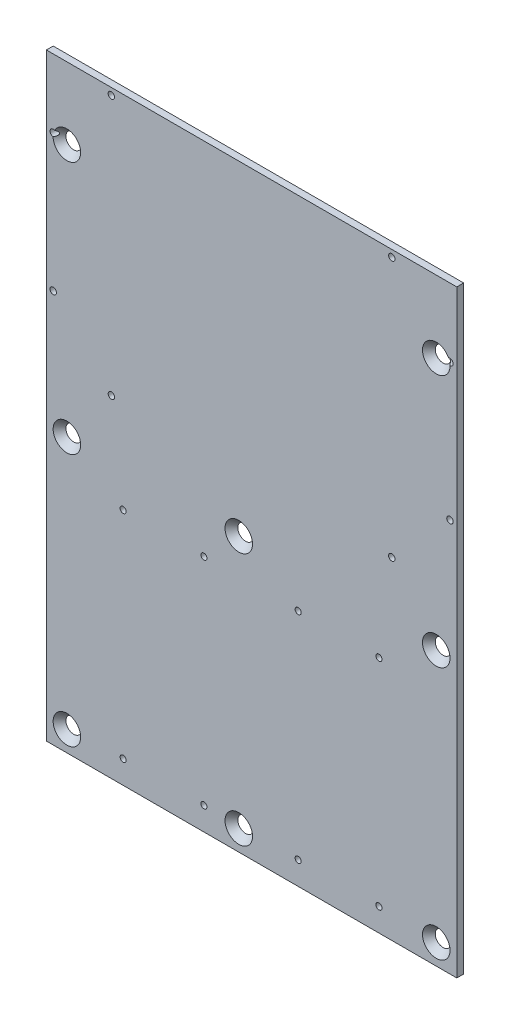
from build123d import *

# Parameters (mm, degrees)
SKETCH1_W                                    = 152.4
SKETCH1_H                                    = 222.25
BOSS_EXTRUDE1_DEPTH                          = 2.54
F_3_32_0_09375_DIAMETER_HOLE1_D              = 2.38125
F_4_40_TAPPED_HOLE1_D                        = 2.2606
CSK_FOR_10_FLAT_HEAD_MACHINE_SCREW1_AT_COUNT = 2
CSK_FOR_10_FLAT_HEAD_MACHINE_SCREW1_AT_PITCH = 63.8302
CSK_FOR_10_FLAT_HEAD_MACHINE_SCREW1_2_COUNT  = 2
CSK_FOR_10_FLAT_HEAD_MACHINE_SCREW1_2_PITCH  = 73.3298
CSK_FOR_10_FLAT_HEAD_MACHINE_SCREW1_3_COUNT  = 2
CSK_FOR_10_FLAT_HEAD_MACHINE_SCREW1_3_PITCH  = 93.98
CSK_FOR_10_FLAT_HEAD_MACHINE_SCREW1_4_COUNT  = 2
CSK_FOR_10_FLAT_HEAD_MACHINE_SCREW1_4_PITCH  = 113.606931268
CSK_FOR_10_FLAT_HEAD_MACHINE_SCREW1_5_COUNT  = 2
CSK_FOR_10_FLAT_HEAD_MACHINE_SCREW1_5_PITCH  = 119.203607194
CSK_FOR_10_FLAT_HEAD_MACHINE_SCREW1_6_COUNT  = 2
CSK_FOR_10_FLAT_HEAD_MACHINE_SCREW1_6_PITCH  = 201.757828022
CSK_FOR_10_FLAT_HEAD_MACHINE_SCREW1_7_COUNT  = 2
CSK_FOR_10_FLAT_HEAD_MACHINE_SCREW1_7_PITCH  = 198.50253407


with BuildPart() as part:
    # Sketch1 → Boss-Extrude1 (new body)
    with BuildSketch(Plane.XY):
        Rectangle(SKETCH1_W, SKETCH1_H)
    extrude(amount=BOSS_EXTRUDE1_DEPTH)

    # 3_32 _0.09375_ Diameter Hole1 (through all)
    with Locations(Plane.XY.offset(2.54)):
        with Locations((52.07, 108.585), (73.66, 85.725), (73.66, 34.925), (52.07, 12.065), (-52.07, 12.065), (-73.66, 34.925), (-52.07, 108.585), (-73.66, 85.725)):
            Hole(F_3_32_0_09375_DIAMETER_HOLE1_D / 2)

    # 4-40 Tapped Hole1 (through all)
    with Locations(Plane.XY.offset(2.54)):
        with Locations((47.3, -22.545), (-17.7, -22.545), (-47.7, -22.545), (17.3, -22.545), (47.3, -102.545), (17.3, -102.545), (-17.7, -102.545), (-47.7, -102.545)):
            Hole(F_4_40_TAPPED_HOLE1_D / 2)

    # Sketch9 → CSK for _10 Flat Head Machine Screw1 (revolve, cut)
    with BuildSketch(Plane(origin=(-4.7498, -103.505, 2.54), x_dir=(0, -1, 0), z_dir=(1, 0, 0))):
        Polygon((0, 0), (0, 2.54), (2.5527, 2.54), (2.5527, 2.942184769), (5.1103022, 0), align=None)
    csk_for_10_flat_head_machine_screw1 = revolve(axis=Axis((-4.7498, -103.505, 8.89), (0, 0, -1)), mode=Mode.SUBTRACT)

    # CSK for _10 Flat Head Machine Screw1 at: CSK for _10 Flat Head Machine Screw1 ×2
    with Locations(*[(-i * CSK_FOR_10_FLAT_HEAD_MACHINE_SCREW1_AT_PITCH, 0, 0) for i in range(1, CSK_FOR_10_FLAT_HEAD_MACHINE_SCREW1_AT_COUNT)]):
        add(csk_for_10_flat_head_machine_screw1, mode=Mode.SUBTRACT)

    # CSK for _10 Flat Head Machine Screw1 2: CSK for _10 Flat Head Machine Screw1 ×2
    with Locations(*[(i * CSK_FOR_10_FLAT_HEAD_MACHINE_SCREW1_2_PITCH, 0, 0) for i in range(1, CSK_FOR_10_FLAT_HEAD_MACHINE_SCREW1_2_COUNT)]):
        add(csk_for_10_flat_head_machine_screw1, mode=Mode.SUBTRACT)

    # CSK for _10 Flat Head Machine Screw1 3: CSK for _10 Flat Head Machine Screw1 ×2
    with Locations(*[(0, i * CSK_FOR_10_FLAT_HEAD_MACHINE_SCREW1_3_PITCH, 0) for i in range(1, CSK_FOR_10_FLAT_HEAD_MACHINE_SCREW1_3_COUNT)]):
        add(csk_for_10_flat_head_machine_screw1, mode=Mode.SUBTRACT)

    # CSK for _10 Flat Head Machine Screw1 4: CSK for _10 Flat Head Machine Screw1 ×2
    with Locations(*[Vector(-0.5618512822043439, 0.8272382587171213, 0) * (i * CSK_FOR_10_FLAT_HEAD_MACHINE_SCREW1_4_PITCH) for i in range(1, CSK_FOR_10_FLAT_HEAD_MACHINE_SCREW1_4_COUNT)]):
        add(csk_for_10_flat_head_machine_screw1, mode=Mode.SUBTRACT)

    # CSK for _10 Flat Head Machine Screw1 5: CSK for _10 Flat Head Machine Screw1 ×2
    with Locations(*[Vector(0.6151642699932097, 0.788398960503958, 0) * (i * CSK_FOR_10_FLAT_HEAD_MACHINE_SCREW1_5_PITCH) for i in range(1, CSK_FOR_10_FLAT_HEAD_MACHINE_SCREW1_5_COUNT)]):
        add(csk_for_10_flat_head_machine_screw1, mode=Mode.SUBTRACT)

    # CSK for _10 Flat Head Machine Screw1 6: CSK for _10 Flat Head Machine Screw1 ×2
    with Locations(*[Vector(0.36345454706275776, 0.9316119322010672, 0) * (i * CSK_FOR_10_FLAT_HEAD_MACHINE_SCREW1_6_PITCH) for i in range(1, CSK_FOR_10_FLAT_HEAD_MACHINE_SCREW1_6_COUNT)]):
        add(csk_for_10_flat_head_machine_screw1, mode=Mode.SUBTRACT)

    # CSK for _10 Flat Head Machine Screw1 7: CSK for _10 Flat Head Machine Screw1 ×2
    with Locations(*[Vector(-0.32155861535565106, 0.946889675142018, 0) * (i * CSK_FOR_10_FLAT_HEAD_MACHINE_SCREW1_7_PITCH) for i in range(1, CSK_FOR_10_FLAT_HEAD_MACHINE_SCREW1_7_COUNT)]):
        add(csk_for_10_flat_head_machine_screw1, mode=Mode.SUBTRACT)


solid = part.part
